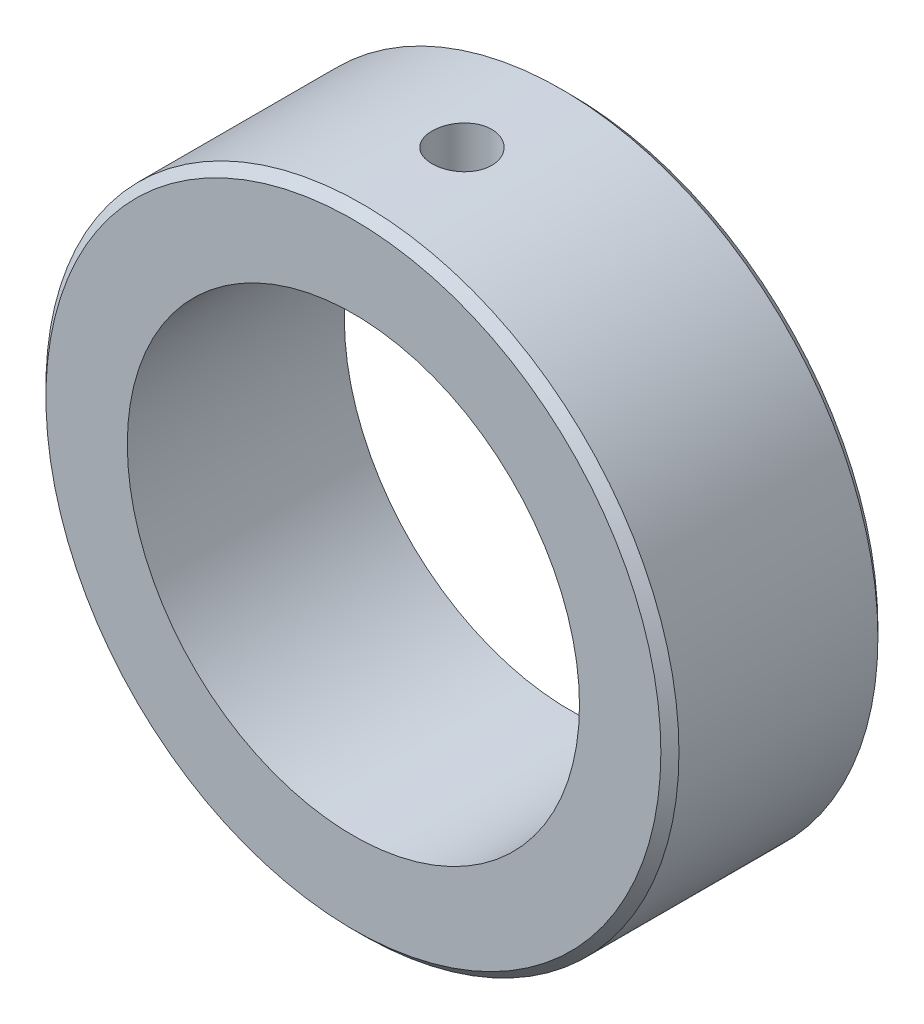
from build123d import *

# Parameters (mm, degrees)
EXTRUSION1_DEPTH      = 6
EXTRUSION1_DEPTH_BACK = 6
ESQUISSE1_R           = 17.5
ESQUISSE1_R_2         = 12.5
ESQUISSE2_W           = 1.65
ESQUISSE2_H           = 17.5
CHANFREIN1_SIZE       = 0.5


with BuildPart() as part:
    # Esquisse1 → Extrusion1 (new, two sides: drawn at the far end of the back side and taken through both)
    with BuildSketch(Plane.XY.offset(-EXTRUSION1_DEPTH_BACK)):
        Circle(ESQUISSE1_R)
        Circle(ESQUISSE1_R_2, mode=Mode.SUBTRACT)
    extrude(amount=EXTRUSION1_DEPTH + EXTRUSION1_DEPTH_BACK)

    # Esquisse2 → Trou taraud_ M41 (revolve, cut)
    with BuildSketch(Plane(origin=(0, 0, 0), x_dir=(0, 0, -1), z_dir=(1, 0, 0))):
        with Locations((0.825, 8.75)):
            Rectangle(ESQUISSE2_W, ESQUISSE2_H)
    revolve(axis=Axis((0, -6.35, 0), (0, 1, 0)), mode=Mode.SUBTRACT)

    # Chanfrein1
    chanfrein1_edges = [part.edges().sort_by_distance(p)[0] for p in [
        (-17.5, 0, 6),
        (-17.5, 0, -6),
    ]]
    chamfer(chanfrein1_edges, length=CHANFREIN1_SIZE)


solid = part.part
